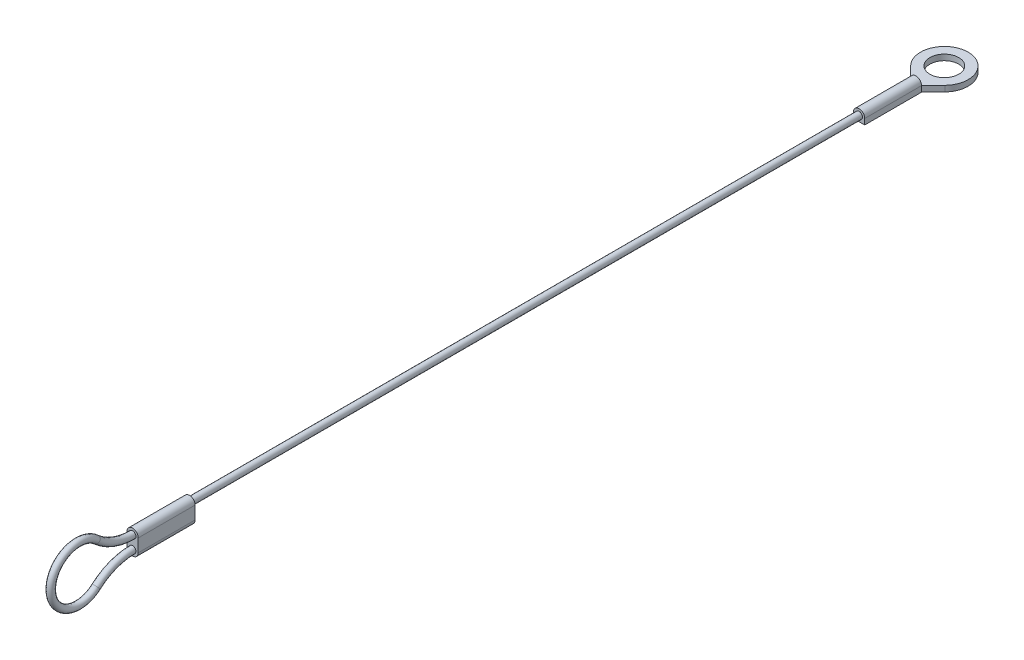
ISO-10303-21;
HEADER;
FILE_DESCRIPTION(('STEP AP214'),'2;1');
FILE_NAME('part.step','',(''),(''),'','','');
FILE_SCHEMA(('AUTOMOTIVE_DESIGN { 1 0 10303 214 1 1 1 1 }'));
ENDSEC;
DATA;
#1=APPLICATION_CONTEXT('core data for automotive mechanical design processes');
#2=APPLICATION_PROTOCOL_DEFINITION('international standard','automotive_design',2000,#1);
#3=PRODUCT_CONTEXT('',#1,'mechanical');
#4=PRODUCT('Part','Part','',(#3));
#5=PRODUCT_RELATED_PRODUCT_CATEGORY('part','',(#4));
#6=PRODUCT_DEFINITION_FORMATION('','',#4);
#7=PRODUCT_DEFINITION_CONTEXT('part definition',#1,'design');
#8=PRODUCT_DEFINITION('design','',#6,#7);
#9=PRODUCT_DEFINITION_SHAPE('','',#8);
#10=(LENGTH_UNIT() NAMED_UNIT(*) SI_UNIT(.MILLI.,.METRE.));
#11=(NAMED_UNIT(*) PLANE_ANGLE_UNIT() SI_UNIT($,.RADIAN.));
#12=(NAMED_UNIT(*) SI_UNIT($,.STERADIAN.) SOLID_ANGLE_UNIT());
#13=UNCERTAINTY_MEASURE_WITH_UNIT(LENGTH_MEASURE(1.E-05),#10,'distance_accuracy_value','');
#14=(GEOMETRIC_REPRESENTATION_CONTEXT(3) GLOBAL_UNCERTAINTY_ASSIGNED_CONTEXT((#13)) GLOBAL_UNIT_ASSIGNED_CONTEXT((#10,
#11,#12)) REPRESENTATION_CONTEXT('',''));
#15=CARTESIAN_POINT('',(0.,0.,0.));
#16=DIRECTION('',(0.,0.,1.));
#17=DIRECTION('',(1.,0.,0.));
#18=AXIS2_PLACEMENT_3D('',#15,#16,#17);
#19=CARTESIAN_POINT('',(0.,0.,-10.));
#20=DIRECTION('',(0.,0.,-1.));
#21=DIRECTION('',(-1.,0.,0.));
#22=AXIS2_PLACEMENT_3D('',#19,#20,#21);
#23=PLANE('',#22);
#24=CARTESIAN_POINT('',(0.,0.,-10.));
#25=DIRECTION('',(0.,0.,-1.));
#26=DIRECTION('',(-1.,0.,0.));
#27=AXIS2_PLACEMENT_3D('',#24,#25,#26);
#28=CIRCLE('',#27,0.995);
#29=CARTESIAN_POINT('',(-0.995,0.00749999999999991,-10.));
#30=VERTEX_POINT('',#29);
#31=CARTESIAN_POINT('',(0.995,0.00749999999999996,-10.));
#32=VERTEX_POINT('',#31);
#33=EDGE_CURVE('E177',#30,#32,#28,.T.);
#34=ORIENTED_EDGE('',*,*,#33,.T.);
#35=DIRECTION('',(-1.,0.,0.));
#36=VECTOR('',#35,1.);
#37=CARTESIAN_POINT('',(-0.995,0.015,-10.));
#38=LINE('',#37,#36);
#39=EDGE_CURVE('E135',#32,#30,#38,.T.);
#40=ORIENTED_EDGE('',*,*,#39,.T.);
#41=EDGE_LOOP('',(#34,#40));
#42=FACE_BOUND('',#41,.T.);
#43=ADVANCED_FACE('F39',(#42),#23,.T.);
#44=CARTESIAN_POINT('',(0.,0.,127.8));
#45=DIRECTION('',(0.,0.,-1.));
#46=DIRECTION('',(-1.,0.,0.));
#47=AXIS2_PLACEMENT_3D('',#44,#45,#46);
#48=CYLINDRICAL_SURFACE('',#47,0.595);
#49=CARTESIAN_POINT('',(0.,0.,117.8));
#50=DIRECTION('',(0.,0.,-1.));
#51=DIRECTION('',(0.,1.,0.));
#52=AXIS2_PLACEMENT_3D('',#49,#50,#51);
#53=CIRCLE('',#52,0.595);
#54=CARTESIAN_POINT('',(0.,0.595,117.8));
#55=VERTEX_POINT('',#54);
#56=EDGE_CURVE('E224',#55,#55,#53,.T.);
#57=ORIENTED_EDGE('',*,*,#56,.T.);
#58=EDGE_LOOP('',(#57));
#59=FACE_BOUND('',#58,.T.);
#60=CARTESIAN_POINT('',(0.,0.,0.));
#61=DIRECTION('',(0.,0.,1.));
#62=DIRECTION('',(1.,0.,0.));
#63=AXIS2_PLACEMENT_3D('',#60,#61,#62);
#64=CIRCLE('',#63,0.595);
#65=CARTESIAN_POINT('',(0.595,0.,0.));
#66=VERTEX_POINT('',#65);
#67=EDGE_CURVE('E200',#66,#66,#64,.T.);
#68=ORIENTED_EDGE('',*,*,#67,.T.);
#69=EDGE_LOOP('',(#68));
#70=FACE_BOUND('',#69,.T.);
#71=ADVANCED_FACE('F41',(#59,#70),#48,.T.);
#72=CARTESIAN_POINT('',(0.,1.70292021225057E-13,117.8));
#73=DIRECTION('',(0.,0.,1.));
#74=DIRECTION('',(0.,-1.,0.));
#75=AXIS2_PLACEMENT_3D('',#72,#73,#74);
#76=CYLINDRICAL_SURFACE('',#75,0.995);
#77=CARTESIAN_POINT('',(0.,1.8474805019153E-13,127.8));
#78=DIRECTION('',(0.,0.,-1.));
#79=DIRECTION('',(0.,1.,0.));
#80=AXIS2_PLACEMENT_3D('',#77,#78,#79);
#81=CIRCLE('',#80,0.995);
#82=CARTESIAN_POINT('',(-0.995,1.84869902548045E-13,127.8));
#83=VERTEX_POINT('',#82);
#84=CARTESIAN_POINT('',(0.995,1.84626197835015E-13,127.8));
#85=VERTEX_POINT('',#84);
#86=EDGE_CURVE('E195',#83,#85,#81,.T.);
#87=ORIENTED_EDGE('',*,*,#86,.T.);
#88=DIRECTION('',(0.,0.,1.));
#89=VECTOR('',#88,1.);
#90=CARTESIAN_POINT('',(0.995,1.70170168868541E-13,117.8));
#91=LINE('',#90,#89);
#92=CARTESIAN_POINT('',(0.995,1.70170168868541E-13,117.8));
#93=VERTEX_POINT('',#92);
#94=EDGE_CURVE('E217',#93,#85,#91,.T.);
#95=ORIENTED_EDGE('',*,*,#94,.F.);
#96=CARTESIAN_POINT('',(0.,1.70292021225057E-13,117.8));
#97=DIRECTION('',(0.,0.,-1.));
#98=DIRECTION('',(0.,1.,0.));
#99=AXIS2_PLACEMENT_3D('',#96,#97,#98);
#100=CIRCLE('',#99,0.995);
#101=CARTESIAN_POINT('',(-0.995,1.70413873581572E-13,117.8));
#102=VERTEX_POINT('',#101);
#103=EDGE_CURVE('E184',#102,#93,#100,.T.);
#104=ORIENTED_EDGE('',*,*,#103,.F.);
#105=DIRECTION('',(0.,0.,1.));
#106=VECTOR('',#105,1.);
#107=CARTESIAN_POINT('',(-0.995,1.70413873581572E-13,117.8));
#108=LINE('',#107,#106);
#109=EDGE_CURVE('E194',#102,#83,#108,.T.);
#110=ORIENTED_EDGE('',*,*,#109,.T.);
#111=EDGE_LOOP('',(#87,#95,#104,#110));
#112=FACE_BOUND('',#111,.T.);
#113=ADVANCED_FACE('F418',(#112),#76,.T.);
#114=CARTESIAN_POINT('',(0.995,1.70170168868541E-13,117.8));
#115=DIRECTION('',(-1.,0.,0.));
#116=DIRECTION('',(0.,-1.,0.));
#117=AXIS2_PLACEMENT_3D('',#114,#115,#116);
#118=PLANE('',#117);
#119=DIRECTION('',(0.,-1.,0.));
#120=VECTOR('',#119,1.);
#121=CARTESIAN_POINT('',(0.995,1.84626197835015E-13,127.8));
#122=LINE('',#121,#120);
#123=CARTESIAN_POINT('',(0.995,-2.26625258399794,127.8));
#124=VERTEX_POINT('',#123);
#125=EDGE_CURVE('E199',#85,#124,#122,.T.);
#126=ORIENTED_EDGE('',*,*,#125,.T.);
#127=DIRECTION('',(0.,0.,1.));
#128=VECTOR('',#127,1.);
#129=CARTESIAN_POINT('',(0.995,-2.26625258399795,117.8));
#130=LINE('',#129,#128);
#131=CARTESIAN_POINT('',(0.995,-2.26625258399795,117.8));
#132=VERTEX_POINT('',#131);
#133=EDGE_CURVE('E213',#132,#124,#130,.T.);
#134=ORIENTED_EDGE('',*,*,#133,.F.);
#135=DIRECTION('',(0.,-1.,0.));
#136=VECTOR('',#135,1.);
#137=CARTESIAN_POINT('',(0.995,1.70170168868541E-13,117.8));
#138=LINE('',#137,#136);
#139=EDGE_CURVE('E87',#93,#132,#138,.T.);
#140=ORIENTED_EDGE('',*,*,#139,.F.);
#141=ORIENTED_EDGE('',*,*,#94,.T.);
#142=EDGE_LOOP('',(#126,#134,#140,#141));
#143=FACE_BOUND('',#142,.T.);
#144=ADVANCED_FACE('F411',(#143),#118,.F.);
#145=CARTESIAN_POINT('',(0.,-2.26625258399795,117.8));
#146=DIRECTION('',(0.,0.,1.));
#147=DIRECTION('',(0.,-1.,0.));
#148=AXIS2_PLACEMENT_3D('',#145,#146,#147);
#149=CYLINDRICAL_SURFACE('',#148,0.995);
#150=CARTESIAN_POINT('',(0.,-2.26625258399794,127.8));
#151=DIRECTION('',(0.,0.,-1.));
#152=DIRECTION('',(0.,1.,0.));
#153=AXIS2_PLACEMENT_3D('',#150,#151,#152);
#154=CIRCLE('',#153,0.995);
#155=CARTESIAN_POINT('',(-0.995,-2.26625258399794,127.8));
#156=VERTEX_POINT('',#155);
#157=EDGE_CURVE('E203',#124,#156,#154,.T.);
#158=ORIENTED_EDGE('',*,*,#157,.T.);
#159=DIRECTION('',(0.,0.,1.));
#160=VECTOR('',#159,1.);
#161=CARTESIAN_POINT('',(-0.995,-2.26625258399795,117.8));
#162=LINE('',#161,#160);
#163=CARTESIAN_POINT('',(-0.995,-2.26625258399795,117.8));
#164=VERTEX_POINT('',#163);
#165=EDGE_CURVE('E210',#164,#156,#162,.T.);
#166=ORIENTED_EDGE('',*,*,#165,.F.);
#167=CARTESIAN_POINT('',(0.,-2.26625258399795,117.8));
#168=DIRECTION('',(0.,0.,-1.));
#169=DIRECTION('',(0.,1.,0.));
#170=AXIS2_PLACEMENT_3D('',#167,#168,#169);
#171=CIRCLE('',#170,0.995);
#172=EDGE_CURVE('E189',#132,#164,#171,.T.);
#173=ORIENTED_EDGE('',*,*,#172,.F.);
#174=ORIENTED_EDGE('',*,*,#133,.T.);
#175=EDGE_LOOP('',(#158,#166,#173,#174));
#176=FACE_BOUND('',#175,.T.);
#177=ADVANCED_FACE('F405',(#176),#149,.T.);
#178=CARTESIAN_POINT('',(-0.995,1.70413873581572E-13,117.8));
#179=DIRECTION('',(1.,0.,0.));
#180=DIRECTION('',(0.,0.,-1.));
#181=AXIS2_PLACEMENT_3D('',#178,#179,#180);
#182=PLANE('',#181);
#183=DIRECTION('',(0.,1.,0.));
#184=VECTOR('',#183,1.);
#185=CARTESIAN_POINT('',(-0.995,1.84869902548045E-13,127.8));
#186=LINE('',#185,#184);
#187=EDGE_CURVE('E79',#156,#83,#186,.T.);
#188=ORIENTED_EDGE('',*,*,#187,.T.);
#189=ORIENTED_EDGE('',*,*,#109,.F.);
#190=DIRECTION('',(0.,1.,0.));
#191=VECTOR('',#190,1.);
#192=CARTESIAN_POINT('',(-0.995,1.70413873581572E-13,117.8));
#193=LINE('',#192,#191);
#194=EDGE_CURVE('E59',#164,#102,#193,.T.);
#195=ORIENTED_EDGE('',*,*,#194,.F.);
#196=ORIENTED_EDGE('',*,*,#165,.T.);
#197=EDGE_LOOP('',(#188,#189,#195,#196));
#198=FACE_BOUND('',#197,.T.);
#199=ADVANCED_FACE('F399',(#198),#182,.F.);
#200=CARTESIAN_POINT('',(0.,1.70292021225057E-13,117.8));
#201=DIRECTION('',(0.,0.,-1.));
#202=DIRECTION('',(0.,1.,0.));
#203=AXIS2_PLACEMENT_3D('',#200,#201,#202);
#204=PLANE('',#203);
#205=ORIENTED_EDGE('',*,*,#56,.F.);
#206=EDGE_LOOP('',(#205));
#207=FACE_BOUND('',#206,.T.);
#208=ORIENTED_EDGE('',*,*,#103,.T.);
#209=ORIENTED_EDGE('',*,*,#139,.T.);
#210=ORIENTED_EDGE('',*,*,#172,.T.);
#211=ORIENTED_EDGE('',*,*,#194,.T.);
#212=EDGE_LOOP('',(#208,#209,#210,#211));
#213=FACE_BOUND('',#212,.T.);
#214=ADVANCED_FACE('F278',(#207,#213),#204,.T.);
#215=CARTESIAN_POINT('',(0.,1.8474805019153E-13,127.8));
#216=DIRECTION('',(0.,0.,-1.));
#217=DIRECTION('',(0.,1.,0.));
#218=AXIS2_PLACEMENT_3D('',#215,#216,#217);
#219=PLANE('',#218);
#220=CARTESIAN_POINT('',(0.,-2.26625258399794,127.8));
#221=DIRECTION('',(0.,0.,-1.));
#222=DIRECTION('',(1.,0.,0.));
#223=AXIS2_PLACEMENT_3D('',#220,#221,#222);
#224=CIRCLE('',#223,0.595);
#225=CARTESIAN_POINT('',(0.,-1.67125258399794,127.8));
#226=VERTEX_POINT('',#225);
#227=EDGE_CURVE('E225',#226,#226,#224,.T.);
#228=ORIENTED_EDGE('',*,*,#227,.T.);
#229=EDGE_LOOP('',(#228));
#230=FACE_BOUND('',#229,.T.);
#231=CARTESIAN_POINT('',(0.,0.,127.8));
#232=DIRECTION('',(0.,0.,-1.));
#233=DIRECTION('',(0.,1.,0.));
#234=AXIS2_PLACEMENT_3D('',#231,#232,#233);
#235=CIRCLE('',#234,0.595);
#236=CARTESIAN_POINT('',(0.,-0.595000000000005,127.8));
#237=VERTEX_POINT('',#236);
#238=EDGE_CURVE('E220',#237,#237,#235,.T.);
#239=ORIENTED_EDGE('',*,*,#238,.T.);
#240=EDGE_LOOP('',(#239));
#241=FACE_BOUND('',#240,.T.);
#242=ORIENTED_EDGE('',*,*,#86,.F.);
#243=ORIENTED_EDGE('',*,*,#187,.F.);
#244=ORIENTED_EDGE('',*,*,#157,.F.);
#245=ORIENTED_EDGE('',*,*,#125,.F.);
#246=EDGE_LOOP('',(#242,#243,#244,#245));
#247=FACE_BOUND('',#246,.T.);
#248=ADVANCED_FACE('F387',(#230,#241,#247),#219,.F.);
#249=CARTESIAN_POINT('',(0.,-11.8662525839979,127.8));
#250=DIRECTION('',(1.,0.,0.));
#251=DIRECTION('',(0.,0.,-1.));
#252=AXIS2_PLACEMENT_3D('',#249,#250,#251);
#253=TOROIDAL_SURFACE('',#252,9.6,0.595);
#254=CARTESIAN_POINT('',(0.,-4.71083505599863,134.2));
#255=DIRECTION('',(0.,0.666666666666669,-0.745355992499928));
#256=DIRECTION('',(1.,0.,0.));
#257=AXIS2_PLACEMENT_3D('',#254,#255,#256);
#258=CIRCLE('',#257,0.595);
#259=CARTESIAN_POINT('',(0.,-4.26734824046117,134.596666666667));
#260=VERTEX_POINT('',#259);
#261=EDGE_CURVE('E50',#260,#260,#258,.T.);
#262=CARTESIAN_POINT('',(0.,-11.8662525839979,127.8));
#263=DIRECTION('',(1.,0.,0.));
#264=DIRECTION('',(0.,0.,-1.));
#265=AXIS2_PLACEMENT_3D('',#262,#263,#264);
#266=CIRCLE('',#265,10.195);
#267=EDGE_CURVE('',#226,#260,#266,.T.);
#268=ORIENTED_EDGE('',*,*,#227,.F.);
#269=ORIENTED_EDGE('',*,*,#261,.T.);
#270=ORIENTED_EDGE('',*,*,#267,.T.);
#271=ORIENTED_EDGE('',*,*,#267,.F.);
#272=EDGE_LOOP('',(#268,#270,#269,#271));
#273=FACE_BOUND('',#272,.T.);
#274=ADVANCED_FACE('F380',(#273),#253,.T.);
#275=CARTESIAN_POINT('',(0.,-1.13312629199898,137.4));
#276=DIRECTION('',(-1.,0.,0.));
#277=DIRECTION('',(0.,0.,1.));
#278=AXIS2_PLACEMENT_3D('',#275,#276,#277);
#279=TOROIDAL_SURFACE('',#278,4.79999999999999,0.595);
#280=CARTESIAN_POINT('',(0.,2.44458247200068,134.2));
#281=DIRECTION('',(0.,0.666666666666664,0.745355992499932));
#282=DIRECTION('',(1.,0.,0.));
#283=AXIS2_PLACEMENT_3D('',#280,#281,#282);
#284=CIRCLE('',#283,0.595);
#285=CARTESIAN_POINT('',(0.,2.00109565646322,134.596666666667));
#286=VERTEX_POINT('',#285);
#287=EDGE_CURVE('E11',#286,#286,#284,.T.);
#288=ORIENTED_EDGE('',*,*,#287,.T.);
#289=EDGE_LOOP('',(#288));
#290=FACE_BOUND('',#289,.T.);
#291=ORIENTED_EDGE('',*,*,#261,.F.);
#292=EDGE_LOOP('',(#291));
#293=FACE_BOUND('',#292,.T.);
#294=ADVANCED_FACE('F374',(#290,#293),#279,.T.);
#295=CARTESIAN_POINT('',(0.,9.6,127.8));
#296=DIRECTION('',(1.,0.,0.));
#297=DIRECTION('',(0.,0.,-1.));
#298=AXIS2_PLACEMENT_3D('',#295,#296,#297);
#299=TOROIDAL_SURFACE('',#298,9.6,0.595);
#300=CARTESIAN_POINT('',(0.,9.6,127.8));
#301=DIRECTION('',(1.,0.,0.));
#302=DIRECTION('',(0.,0.,-1.));
#303=AXIS2_PLACEMENT_3D('',#300,#301,#302);
#304=CIRCLE('',#303,10.195);
#305=EDGE_CURVE('',#286,#237,#304,.T.);
#306=ORIENTED_EDGE('',*,*,#287,.F.);
#307=ORIENTED_EDGE('',*,*,#238,.F.);
#308=ORIENTED_EDGE('',*,*,#305,.T.);
#309=ORIENTED_EDGE('',*,*,#305,.F.);
#310=EDGE_LOOP('',(#306,#308,#307,#309));
#311=FACE_BOUND('',#310,.T.);
#312=ADVANCED_FACE('F276',(#311),#299,.T.);
#313=CARTESIAN_POINT('',(0.,0.,-10.));
#314=DIRECTION('',(0.,0.,1.));
#315=DIRECTION('',(1.,0.,0.));
#316=AXIS2_PLACEMENT_3D('',#313,#314,#315);
#317=CYLINDRICAL_SURFACE('',#316,0.995);
#318=CARTESIAN_POINT('',(0.,0.,0.));
#319=DIRECTION('',(0.,0.,-1.));
#320=DIRECTION('',(-1.,0.,0.));
#321=AXIS2_PLACEMENT_3D('',#318,#319,#320);
#322=CIRCLE('',#321,0.995);
#323=CARTESIAN_POINT('',(-0.995,0.,0.));
#324=VERTEX_POINT('',#323);
#325=CARTESIAN_POINT('',(0.995,0.,0.));
#326=VERTEX_POINT('',#325);
#327=EDGE_CURVE('E163',#324,#326,#322,.T.);
#328=ORIENTED_EDGE('',*,*,#327,.T.);
#329=DIRECTION('',(0.,0.,1.));
#330=VECTOR('',#329,1.);
#331=CARTESIAN_POINT('',(0.995,0.,-10.));
#332=LINE('',#331,#330);
#333=EDGE_CURVE('E235',#32,#326,#332,.T.);
#334=ORIENTED_EDGE('',*,*,#333,.F.);
#335=ORIENTED_EDGE('',*,*,#33,.F.);
#336=DIRECTION('',(0.,0.,1.));
#337=VECTOR('',#336,1.);
#338=CARTESIAN_POINT('',(-0.995,0.,-10.));
#339=LINE('',#338,#337);
#340=EDGE_CURVE('E183',#30,#324,#339,.T.);
#341=ORIENTED_EDGE('',*,*,#340,.T.);
#342=EDGE_LOOP('',(#328,#334,#335,#341));
#343=FACE_BOUND('',#342,.T.);
#344=ADVANCED_FACE('F271',(#343),#317,.T.);
#345=CARTESIAN_POINT('',(0.995,0.,-10.));
#346=DIRECTION('',(-1.,0.,0.));
#347=DIRECTION('',(0.,-1.,0.));
#348=AXIS2_PLACEMENT_3D('',#345,#346,#347);
#349=PLANE('',#348);
#350=DIRECTION('',(0.,-1.,0.));
#351=VECTOR('',#350,1.);
#352=CARTESIAN_POINT('',(0.995,0.,0.));
#353=LINE('',#352,#351);
#354=CARTESIAN_POINT('',(0.995,-0.995,0.));
#355=VERTEX_POINT('',#354);
#356=EDGE_CURVE('E167',#326,#355,#353,.T.);
#357=ORIENTED_EDGE('',*,*,#356,.T.);
#358=DIRECTION('',(0.,0.,1.));
#359=VECTOR('',#358,1.);
#360=CARTESIAN_POINT('',(0.995,-0.995,-10.));
#361=LINE('',#360,#359);
#362=CARTESIAN_POINT('',(0.995,-0.995,-10.));
#363=VERTEX_POINT('',#362);
#364=EDGE_CURVE('E182',#363,#355,#361,.T.);
#365=ORIENTED_EDGE('',*,*,#364,.F.);
#366=DIRECTION('',(0.,-1.,0.));
#367=VECTOR('',#366,1.);
#368=CARTESIAN_POINT('',(0.995,0.,-10.));
#369=LINE('',#368,#367);
#370=EDGE_CURVE('E247',#32,#363,#369,.T.);
#371=ORIENTED_EDGE('',*,*,#370,.F.);
#372=ORIENTED_EDGE('',*,*,#333,.T.);
#373=EDGE_LOOP('',(#357,#365,#371,#372));
#374=FACE_BOUND('',#373,.T.);
#375=ADVANCED_FACE('F260',(#374),#349,.F.);
#376=CARTESIAN_POINT('',(0.,-0.995,-10.));
#377=DIRECTION('',(0.,1.,0.));
#378=DIRECTION('',(0.,0.,1.));
#379=AXIS2_PLACEMENT_3D('',#376,#377,#378);
#380=PLANE('',#379);
#381=DIRECTION('',(-1.,0.,0.));
#382=VECTOR('',#381,1.);
#383=CARTESIAN_POINT('',(0.,-0.995,0.));
#384=LINE('',#383,#382);
#385=CARTESIAN_POINT('',(-0.995,-0.995,0.));
#386=VERTEX_POINT('',#385);
#387=EDGE_CURVE('E171',#355,#386,#384,.T.);
#388=ORIENTED_EDGE('',*,*,#387,.T.);
#389=DIRECTION('',(0.,0.,1.));
#390=VECTOR('',#389,1.);
#391=CARTESIAN_POINT('',(-0.995,-0.995,-10.));
#392=LINE('',#391,#390);
#393=CARTESIAN_POINT('',(-0.995,-0.995,-10.));
#394=VERTEX_POINT('',#393);
#395=EDGE_CURVE('E178',#394,#386,#392,.T.);
#396=ORIENTED_EDGE('',*,*,#395,.F.);
#397=DIRECTION('',(-0.694897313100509,0.,-0.719108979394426));
#398=VECTOR('',#397,1.);
#399=CARTESIAN_POINT('',(-3.01306662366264,-0.995,-12.0883802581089));
#400=LINE('',#399,#398);
#401=CARTESIAN_POINT('',(-3.01306662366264,-0.995,-12.0883802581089));
#402=VERTEX_POINT('',#401);
#403=EDGE_CURVE('E513',#394,#402,#400,.T.);
#404=ORIENTED_EDGE('',*,*,#403,.T.);
#405=CARTESIAN_POINT('',(0.,-0.995,-15.));
#406=DIRECTION('',(0.,-1.,0.));
#407=DIRECTION('',(0.,0.,1.));
#408=AXIS2_PLACEMENT_3D('',#405,#406,#407);
#409=CIRCLE('',#408,4.19);
#410=CARTESIAN_POINT('',(3.01306662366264,-0.995,-12.0883802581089));
#411=VERTEX_POINT('',#410);
#412=EDGE_CURVE('E129',#402,#411,#409,.T.);
#413=ORIENTED_EDGE('',*,*,#412,.T.);
#414=DIRECTION('',(-0.694897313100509,0.,0.719108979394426));
#415=VECTOR('',#414,1.);
#416=CARTESIAN_POINT('',(0.995,-0.995,-10.));
#417=LINE('',#416,#415);
#418=EDGE_CURVE('E152',#411,#363,#417,.T.);
#419=ORIENTED_EDGE('',*,*,#418,.T.);
#420=ORIENTED_EDGE('',*,*,#364,.T.);
#421=EDGE_LOOP('',(#388,#396,#404,#413,#419,#420));
#422=FACE_BOUND('',#421,.T.);
#423=CARTESIAN_POINT('',(0.,-0.995,-15.));
#424=DIRECTION('',(0.,-1.,0.));
#425=DIRECTION('',(0.,0.,-1.));
#426=AXIS2_PLACEMENT_3D('',#423,#424,#425);
#427=CIRCLE('',#426,2.54);
#428=CARTESIAN_POINT('',(0.,-0.995,-17.54));
#429=VERTEX_POINT('',#428);
#430=EDGE_CURVE('E509',#429,#429,#427,.T.);
#431=ORIENTED_EDGE('',*,*,#430,.F.);
#432=EDGE_LOOP('',(#431));
#433=FACE_BOUND('',#432,.T.);
#434=ADVANCED_FACE('F270',(#422,#433),#380,.F.);
#435=CARTESIAN_POINT('',(-0.995,-0.995,-10.));
#436=DIRECTION('',(1.,0.,0.));
#437=DIRECTION('',(0.,1.,0.));
#438=AXIS2_PLACEMENT_3D('',#435,#436,#437);
#439=PLANE('',#438);
#440=DIRECTION('',(0.,1.,0.));
#441=VECTOR('',#440,1.);
#442=CARTESIAN_POINT('',(-0.995,-0.995,0.));
#443=LINE('',#442,#441);
#444=EDGE_CURVE('E174',#386,#324,#443,.T.);
#445=ORIENTED_EDGE('',*,*,#444,.T.);
#446=ORIENTED_EDGE('',*,*,#340,.F.);
#447=DIRECTION('',(0.,1.,0.));
#448=VECTOR('',#447,1.);
#449=CARTESIAN_POINT('',(-0.995,-0.995,-10.));
#450=LINE('',#449,#448);
#451=EDGE_CURVE('E149',#394,#30,#450,.T.);
#452=ORIENTED_EDGE('',*,*,#451,.F.);
#453=ORIENTED_EDGE('',*,*,#395,.T.);
#454=EDGE_LOOP('',(#445,#446,#452,#453));
#455=FACE_BOUND('',#454,.T.);
#456=ADVANCED_FACE('F314',(#455),#439,.F.);
#457=CARTESIAN_POINT('',(0.,0.,0.));
#458=DIRECTION('',(0.,0.,-1.));
#459=DIRECTION('',(-1.,0.,0.));
#460=AXIS2_PLACEMENT_3D('',#457,#458,#459);
#461=PLANE('',#460);
#462=ORIENTED_EDGE('',*,*,#67,.F.);
#463=EDGE_LOOP('',(#462));
#464=FACE_BOUND('',#463,.T.);
#465=ORIENTED_EDGE('',*,*,#327,.F.);
#466=ORIENTED_EDGE('',*,*,#444,.F.);
#467=ORIENTED_EDGE('',*,*,#387,.F.);
#468=ORIENTED_EDGE('',*,*,#356,.F.);
#469=EDGE_LOOP('',(#465,#466,#467,#468));
#470=FACE_BOUND('',#469,.T.);
#471=ADVANCED_FACE('F310',(#464,#470),#461,.F.);
#472=CARTESIAN_POINT('',(-3.01306662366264,0.015,-12.0883802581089));
#473=DIRECTION('',(-0.719108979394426,0.,0.694897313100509));
#474=DIRECTION('',(0.694897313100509,0.,0.719108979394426));
#475=AXIS2_PLACEMENT_3D('',#472,#473,#474);
#476=PLANE('',#475);
#477=ORIENTED_EDGE('',*,*,#403,.F.);
#478=ORIENTED_EDGE('',*,*,#451,.T.);
#479=DIRECTION('',(-0.694897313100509,0.,-0.719108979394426));
#480=VECTOR('',#479,1.);
#481=CARTESIAN_POINT('',(-3.01306662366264,0.015,-12.0883802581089));
#482=LINE('',#481,#480);
#483=CARTESIAN_POINT('',(-3.01306662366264,0.015,-12.0883802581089));
#484=VERTEX_POINT('',#483);
#485=EDGE_CURVE('E142',#30,#484,#482,.T.);
#486=ORIENTED_EDGE('',*,*,#485,.T.);
#487=DIRECTION('',(0.,-1.,0.));
#488=VECTOR('',#487,1.);
#489=CARTESIAN_POINT('',(-3.01306662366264,0.015,-12.0883802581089));
#490=LINE('',#489,#488);
#491=EDGE_CURVE('E124',#484,#402,#490,.T.);
#492=ORIENTED_EDGE('',*,*,#491,.T.);
#493=EDGE_LOOP('',(#477,#478,#486,#492));
#494=FACE_BOUND('',#493,.T.);
#495=ADVANCED_FACE('F147',(#494),#476,.T.);
#496=CARTESIAN_POINT('',(0.995,0.015,-10.));
#497=DIRECTION('',(0.719108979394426,0.,0.694897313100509));
#498=DIRECTION('',(0.694897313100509,0.,-0.719108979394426));
#499=AXIS2_PLACEMENT_3D('',#496,#497,#498);
#500=PLANE('',#499);
#501=ORIENTED_EDGE('',*,*,#418,.F.);
#502=DIRECTION('',(0.,-1.,0.));
#503=VECTOR('',#502,1.);
#504=CARTESIAN_POINT('',(3.01306662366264,0.015,-12.0883802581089));
#505=LINE('',#504,#503);
#506=CARTESIAN_POINT('',(3.01306662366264,0.015,-12.0883802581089));
#507=VERTEX_POINT('',#506);
#508=EDGE_CURVE('E134',#507,#411,#505,.T.);
#509=ORIENTED_EDGE('',*,*,#508,.F.);
#510=DIRECTION('',(-0.694897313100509,0.,0.719108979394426));
#511=VECTOR('',#510,1.);
#512=CARTESIAN_POINT('',(0.995,0.015,-10.));
#513=LINE('',#512,#511);
#514=EDGE_CURVE('E144',#507,#32,#513,.T.);
#515=ORIENTED_EDGE('',*,*,#514,.T.);
#516=ORIENTED_EDGE('',*,*,#370,.T.);
#517=EDGE_LOOP('',(#501,#509,#515,#516));
#518=FACE_BOUND('',#517,.T.);
#519=ADVANCED_FACE('F329',(#518),#500,.T.);
#520=CARTESIAN_POINT('',(0.,0.015,-15.));
#521=DIRECTION('',(0.,-1.,0.));
#522=DIRECTION('',(0.,0.,-1.));
#523=AXIS2_PLACEMENT_3D('',#520,#521,#522);
#524=CYLINDRICAL_SURFACE('',#523,4.19);
#525=ORIENTED_EDGE('',*,*,#412,.F.);
#526=ORIENTED_EDGE('',*,*,#491,.F.);
#527=CARTESIAN_POINT('',(0.,0.015,-15.));
#528=DIRECTION('',(0.,-1.,0.));
#529=DIRECTION('',(0.,0.,1.));
#530=AXIS2_PLACEMENT_3D('',#527,#528,#529);
#531=CIRCLE('',#530,4.19);
#532=EDGE_CURVE('E127',#484,#507,#531,.T.);
#533=ORIENTED_EDGE('',*,*,#532,.T.);
#534=ORIENTED_EDGE('',*,*,#508,.T.);
#535=EDGE_LOOP('',(#525,#526,#533,#534));
#536=FACE_BOUND('',#535,.T.);
#537=ADVANCED_FACE('F126',(#536),#524,.T.);
#538=CARTESIAN_POINT('',(0.,0.015,-15.));
#539=DIRECTION('',(0.,1.,0.));
#540=DIRECTION('',(0.,0.,1.));
#541=AXIS2_PLACEMENT_3D('',#538,#539,#540);
#542=PLANE('',#541);
#543=CARTESIAN_POINT('',(0.,0.015,-15.));
#544=DIRECTION('',(0.,-1.,0.));
#545=DIRECTION('',(0.,0.,-1.));
#546=AXIS2_PLACEMENT_3D('',#543,#544,#545);
#547=CIRCLE('',#546,2.54);
#548=CARTESIAN_POINT('',(0.,0.015,-17.54));
#549=VERTEX_POINT('',#548);
#550=EDGE_CURVE('E506',#549,#549,#547,.T.);
#551=ORIENTED_EDGE('',*,*,#550,.T.);
#552=EDGE_LOOP('',(#551));
#553=FACE_BOUND('',#552,.T.);
#554=ORIENTED_EDGE('',*,*,#485,.F.);
#555=ORIENTED_EDGE('',*,*,#39,.F.);
#556=ORIENTED_EDGE('',*,*,#514,.F.);
#557=ORIENTED_EDGE('',*,*,#532,.F.);
#558=EDGE_LOOP('',(#554,#555,#556,#557));
#559=FACE_BOUND('',#558,.T.);
#560=ADVANCED_FACE('F140',(#553,#559),#542,.T.);
#561=CARTESIAN_POINT('',(0.,0.015,-15.));
#562=DIRECTION('',(0.,-1.,0.));
#563=DIRECTION('',(0.,0.,-1.));
#564=AXIS2_PLACEMENT_3D('',#561,#562,#563);
#565=CYLINDRICAL_SURFACE('',#564,2.54);
#566=ORIENTED_EDGE('',*,*,#550,.F.);
#567=EDGE_LOOP('',(#566));
#568=FACE_BOUND('',#567,.T.);
#569=ORIENTED_EDGE('',*,*,#430,.T.);
#570=EDGE_LOOP('',(#569));
#571=FACE_BOUND('',#570,.T.);
#572=ADVANCED_FACE('F486',(#568,#571),#565,.F.);
#573=CLOSED_SHELL('',(#43,#71,#113,#144,#177,#199,#214,#248,#274,#294,#312,#344,#375,#434,#456,
#471,#495,#519,#537,#560,#572));
#574=MANIFOLD_SOLID_BREP('B2',#573);
#575=ADVANCED_BREP_SHAPE_REPRESENTATION('',(#18,#574),#14);
#576=SHAPE_DEFINITION_REPRESENTATION(#9,#575);
ENDSEC;
END-ISO-10303-21;
